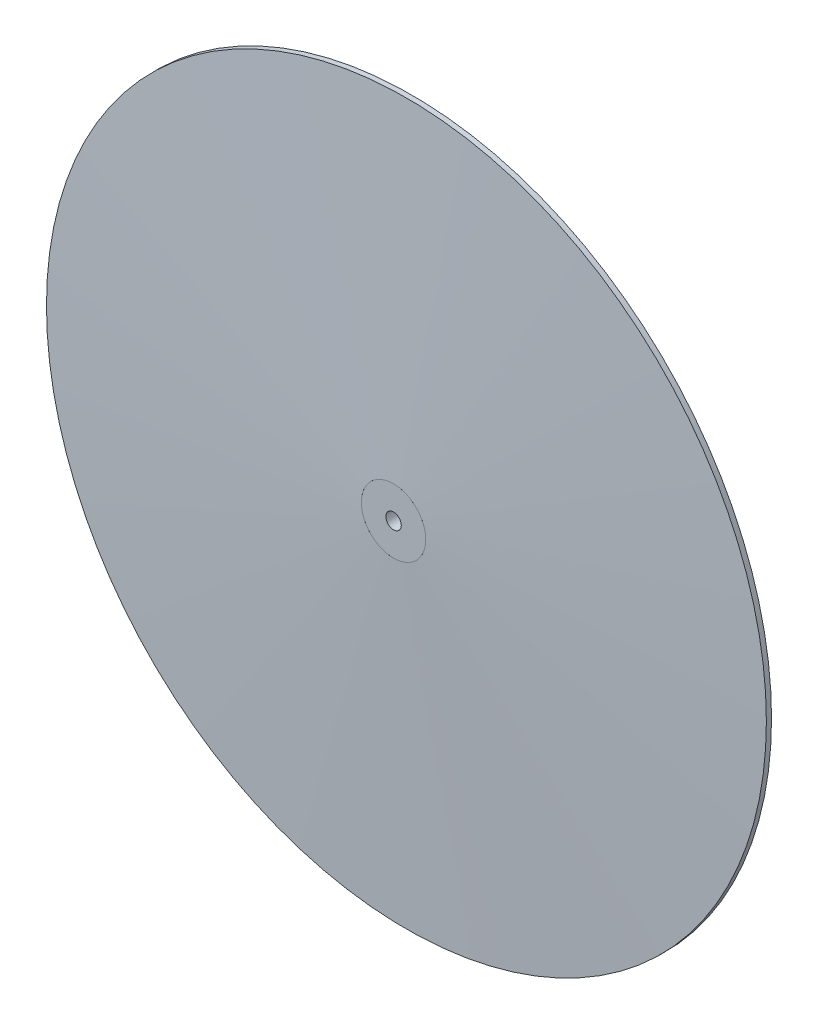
ISO-10303-21;
HEADER;
FILE_DESCRIPTION(('STEP AP214'),'2;1');
FILE_NAME('part.step','',(''),(''),'','','');
FILE_SCHEMA(('AUTOMOTIVE_DESIGN { 1 0 10303 214 1 1 1 1 }'));
ENDSEC;
DATA;
#1=APPLICATION_CONTEXT('core data for automotive mechanical design processes');
#2=APPLICATION_PROTOCOL_DEFINITION('international standard','automotive_design',2000,#1);
#3=PRODUCT_CONTEXT('',#1,'mechanical');
#4=PRODUCT('Part','Part','',(#3));
#5=PRODUCT_RELATED_PRODUCT_CATEGORY('part','',(#4));
#6=PRODUCT_DEFINITION_FORMATION('','',#4);
#7=PRODUCT_DEFINITION_CONTEXT('part definition',#1,'design');
#8=PRODUCT_DEFINITION('design','',#6,#7);
#9=PRODUCT_DEFINITION_SHAPE('','',#8);
#10=(LENGTH_UNIT() NAMED_UNIT(*) SI_UNIT(.MILLI.,.METRE.));
#11=(NAMED_UNIT(*) PLANE_ANGLE_UNIT() SI_UNIT($,.RADIAN.));
#12=(NAMED_UNIT(*) SI_UNIT($,.STERADIAN.) SOLID_ANGLE_UNIT());
#13=UNCERTAINTY_MEASURE_WITH_UNIT(LENGTH_MEASURE(1.E-05),#10,'distance_accuracy_value','');
#14=(GEOMETRIC_REPRESENTATION_CONTEXT(3) GLOBAL_UNCERTAINTY_ASSIGNED_CONTEXT((#13)) GLOBAL_UNIT_ASSIGNED_CONTEXT((#10,
#11,#12)) REPRESENTATION_CONTEXT('',''));
#15=CARTESIAN_POINT('',(0.,0.,0.));
#16=DIRECTION('',(0.,0.,1.));
#17=DIRECTION('',(1.,0.,0.));
#18=AXIS2_PLACEMENT_3D('',#15,#16,#17);
#19=CARTESIAN_POINT('',(0.,0.,12.));
#20=DIRECTION('',(0.,0.,-1.));
#21=DIRECTION('',(-1.,0.,0.));
#22=AXIS2_PLACEMENT_3D('',#19,#20,#21);
#23=CONICAL_SURFACE('',#22,25.,1.53152379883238);
#24=CARTESIAN_POINT('',(0.,0.,2.));
#25=DIRECTION('',(0.,0.,1.));
#26=DIRECTION('',(1.,0.,0.));
#27=AXIS2_PLACEMENT_3D('',#24,#25,#26);
#28=CIRCLE('',#27,279.5);
#29=CARTESIAN_POINT('',(-279.5,0.,2.));
#30=VERTEX_POINT('',#29);
#31=EDGE_CURVE('E54',#30,#30,#28,.T.);
#32=CARTESIAN_POINT('',(0.,0.,12.));
#33=DIRECTION('',(0.,0.,1.));
#34=DIRECTION('',(1.,0.,0.));
#35=AXIS2_PLACEMENT_3D('',#32,#33,#34);
#36=CIRCLE('',#35,25.);
#37=CARTESIAN_POINT('',(-25.,0.,12.));
#38=VERTEX_POINT('',#37);
#39=EDGE_CURVE('E11',#38,#38,#36,.T.);
#40=CARTESIAN_POINT('',(-279.5,0.,2.));
#41=CARTESIAN_POINT('',(-276.848958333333,0.,2.10416666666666));
#42=CARTESIAN_POINT('',(-274.197916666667,0.,2.20833333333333));
#43=CARTESIAN_POINT('',(-268.895833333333,0.,2.41666666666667));
#44=CARTESIAN_POINT('',(-266.244791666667,0.,2.52083333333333));
#45=CARTESIAN_POINT('',(-260.942708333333,0.,2.72916666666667));
#46=CARTESIAN_POINT('',(-258.291666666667,0.,2.83333333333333));
#47=CARTESIAN_POINT('',(-252.989583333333,0.,3.04166666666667));
#48=CARTESIAN_POINT('',(-250.338541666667,0.,3.14583333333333));
#49=CARTESIAN_POINT('',(-245.036458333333,0.,3.35416666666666));
#50=CARTESIAN_POINT('',(-242.385416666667,0.,3.45833333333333));
#51=CARTESIAN_POINT('',(-237.083333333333,0.,3.66666666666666));
#52=CARTESIAN_POINT('',(-234.432291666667,0.,3.77083333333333));
#53=CARTESIAN_POINT('',(-229.130208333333,0.,3.97916666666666));
#54=CARTESIAN_POINT('',(-226.479166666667,0.,4.08333333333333));
#55=CARTESIAN_POINT('',(-221.177083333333,0.,4.29166666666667));
#56=CARTESIAN_POINT('',(-218.526041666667,0.,4.39583333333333));
#57=CARTESIAN_POINT('',(-213.223958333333,0.,4.60416666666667));
#58=CARTESIAN_POINT('',(-210.572916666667,0.,4.70833333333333));
#59=CARTESIAN_POINT('',(-205.270833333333,0.,4.91666666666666));
#60=CARTESIAN_POINT('',(-202.619791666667,0.,5.02083333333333));
#61=CARTESIAN_POINT('',(-197.317708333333,0.,5.22916666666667));
#62=CARTESIAN_POINT('',(-194.666666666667,0.,5.33333333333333));
#63=CARTESIAN_POINT('',(-189.364583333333,0.,5.54166666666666));
#64=CARTESIAN_POINT('',(-186.713541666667,0.,5.64583333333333));
#65=CARTESIAN_POINT('',(-181.411458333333,0.,5.85416666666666));
#66=CARTESIAN_POINT('',(-178.760416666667,0.,5.95833333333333));
#67=CARTESIAN_POINT('',(-173.458333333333,0.,6.16666666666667));
#68=CARTESIAN_POINT('',(-170.807291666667,0.,6.27083333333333));
#69=CARTESIAN_POINT('',(-165.505208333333,0.,6.47916666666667));
#70=CARTESIAN_POINT('',(-162.854166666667,0.,6.58333333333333));
#71=CARTESIAN_POINT('',(-157.552083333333,0.,6.79166666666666));
#72=CARTESIAN_POINT('',(-154.901041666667,0.,6.89583333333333));
#73=CARTESIAN_POINT('',(-149.598958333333,0.,7.10416666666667));
#74=CARTESIAN_POINT('',(-146.947916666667,0.,7.20833333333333));
#75=CARTESIAN_POINT('',(-141.645833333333,0.,7.41666666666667));
#76=CARTESIAN_POINT('',(-138.994791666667,0.,7.52083333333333));
#77=CARTESIAN_POINT('',(-133.692708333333,0.,7.72916666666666));
#78=CARTESIAN_POINT('',(-131.041666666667,0.,7.83333333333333));
#79=CARTESIAN_POINT('',(-125.739583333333,0.,8.04166666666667));
#80=CARTESIAN_POINT('',(-123.088541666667,0.,8.14583333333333));
#81=CARTESIAN_POINT('',(-117.786458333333,0.,8.35416666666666));
#82=CARTESIAN_POINT('',(-115.135416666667,0.,8.45833333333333));
#83=CARTESIAN_POINT('',(-109.833333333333,0.,8.66666666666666));
#84=CARTESIAN_POINT('',(-107.182291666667,0.,8.77083333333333));
#85=CARTESIAN_POINT('',(-101.880208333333,0.,8.97916666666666));
#86=CARTESIAN_POINT('',(-99.2291666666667,0.,9.08333333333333));
#87=CARTESIAN_POINT('',(-93.9270833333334,0.,9.29166666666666));
#88=CARTESIAN_POINT('',(-91.2760416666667,0.,9.39583333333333));
#89=CARTESIAN_POINT('',(-85.9739583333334,0.,9.60416666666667));
#90=CARTESIAN_POINT('',(-83.3229166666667,0.,9.70833333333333));
#91=CARTESIAN_POINT('',(-78.0208333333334,0.,9.91666666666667));
#92=CARTESIAN_POINT('',(-75.3697916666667,0.,10.0208333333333));
#93=CARTESIAN_POINT('',(-70.0677083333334,0.,10.2291666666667));
#94=CARTESIAN_POINT('',(-67.4166666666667,0.,10.3333333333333));
#95=CARTESIAN_POINT('',(-62.1145833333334,0.,10.5416666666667));
#96=CARTESIAN_POINT('',(-59.4635416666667,0.,10.6458333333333));
#97=CARTESIAN_POINT('',(-54.1614583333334,0.,10.8541666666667));
#98=CARTESIAN_POINT('',(-51.5104166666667,0.,10.9583333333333));
#99=CARTESIAN_POINT('',(-46.2083333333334,0.,11.1666666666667));
#100=CARTESIAN_POINT('',(-43.5572916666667,0.,11.2708333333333));
#101=CARTESIAN_POINT('',(-38.2552083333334,0.,11.4791666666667));
#102=CARTESIAN_POINT('',(-35.6041666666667,0.,11.5833333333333));
#103=CARTESIAN_POINT('',(-30.3020833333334,0.,11.7916666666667));
#104=CARTESIAN_POINT('',(-27.6510416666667,0.,11.8958333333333));
#105=CARTESIAN_POINT('',(-25.,0.,12.));
#106=B_SPLINE_CURVE_WITH_KNOTS('',3,(#40,#41,#42,#43,#44,#45,#46,#47,#48,#49,#50,#51,#52,#53,
#54,#55,#56,#57,#58,#59,#60,#61,#62,#63,#64,#65,#66,#67,#68,#69,#70,#71,#72,#73,#74,#75,#76,#77,
#78,#79,#80,#81,#82,#83,#84,#85,#86,#87,#88,#89,#90,#91,#92,#93,#94,#95,#96,#97,#98,#99,#100,
#101,#102,#103,#104,#105),.UNSPECIFIED.,.F.,.F.,(4,2,2,2,2,2,2,2,2,2,2,2,2,2,2,2,2,2,2,2,2,2,2,
2,2,2,2,2,2,2,2,2,4),(0.,7.95926212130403,15.9185242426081,23.8777863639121,31.8370484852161,
39.7963106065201,47.7555727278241,55.7148348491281,63.6740969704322,71.6333590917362,
79.5926212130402,87.5518833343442,95.5111454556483,103.470407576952,111.429669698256,
119.38893181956,127.348193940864,135.307456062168,143.266718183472,151.225980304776,
159.18524242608,167.144504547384,175.103766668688,183.063028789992,191.022290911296,
198.9815530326,206.940815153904,214.900077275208,222.859339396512,230.818601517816,
238.77786363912,246.737125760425,254.696387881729),.UNSPECIFIED.);
#107=EDGE_CURVE('BSEAM40',#30,#38,#106,.T.);
#108=ORIENTED_EDGE('',*,*,#31,.T.);
#109=ORIENTED_EDGE('',*,*,#39,.F.);
#110=ORIENTED_EDGE('',*,*,#107,.T.);
#111=ORIENTED_EDGE('',*,*,#107,.F.);
#112=EDGE_LOOP('',(#108,#110,#109,#111));
#113=FACE_BOUND('',#112,.T.);
#114=ADVANCED_FACE('F40',(#113),#23,.T.);
#115=CARTESIAN_POINT('',(0.,0.,0.));
#116=DIRECTION('',(0.,0.,1.));
#117=DIRECTION('',(1.,0.,0.));
#118=AXIS2_PLACEMENT_3D('',#115,#116,#117);
#119=CYLINDRICAL_SURFACE('',#118,25.);
#120=ORIENTED_EDGE('',*,*,#39,.T.);
#121=EDGE_LOOP('',(#120));
#122=FACE_BOUND('',#121,.T.);
#123=CARTESIAN_POINT('',(0.,0.,-12.));
#124=DIRECTION('',(0.,0.,1.));
#125=DIRECTION('',(1.,0.,0.));
#126=AXIS2_PLACEMENT_3D('',#123,#124,#125);
#127=CIRCLE('',#126,25.);
#128=CARTESIAN_POINT('',(25.0000000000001,0.,-12.));
#129=VERTEX_POINT('',#128);
#130=EDGE_CURVE('E46',#129,#129,#127,.T.);
#131=ORIENTED_EDGE('',*,*,#130,.F.);
#132=EDGE_LOOP('',(#131));
#133=FACE_BOUND('',#132,.T.);
#134=ADVANCED_FACE('F70',(#122,#133),#119,.F.);
#135=CARTESIAN_POINT('',(0.,0.,-2.));
#136=DIRECTION('',(0.,0.,1.));
#137=DIRECTION('',(1.,0.,0.));
#138=AXIS2_PLACEMENT_3D('',#135,#136,#137);
#139=CONICAL_SURFACE('',#138,279.5,1.53152379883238);
#140=CARTESIAN_POINT('',(0.,0.,-2.));
#141=DIRECTION('',(0.,0.,1.));
#142=DIRECTION('',(1.,0.,0.));
#143=AXIS2_PLACEMENT_3D('',#140,#141,#142);
#144=CIRCLE('',#143,279.5);
#145=CARTESIAN_POINT('',(279.5,0.,-2.));
#146=VERTEX_POINT('',#145);
#147=EDGE_CURVE('E50',#146,#146,#144,.T.);
#148=CARTESIAN_POINT('',(25.0000000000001,0.,-12.));
#149=CARTESIAN_POINT('',(27.6510416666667,0.,-11.8958333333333));
#150=CARTESIAN_POINT('',(30.3020833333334,0.,-11.7916666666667));
#151=CARTESIAN_POINT('',(35.6041666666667,0.,-11.5833333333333));
#152=CARTESIAN_POINT('',(38.2552083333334,0.,-11.4791666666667));
#153=CARTESIAN_POINT('',(43.5572916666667,0.,-11.2708333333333));
#154=CARTESIAN_POINT('',(46.2083333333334,0.,-11.1666666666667));
#155=CARTESIAN_POINT('',(51.5104166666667,0.,-10.9583333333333));
#156=CARTESIAN_POINT('',(54.1614583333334,0.,-10.8541666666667));
#157=CARTESIAN_POINT('',(59.4635416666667,0.,-10.6458333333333));
#158=CARTESIAN_POINT('',(62.1145833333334,0.,-10.5416666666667));
#159=CARTESIAN_POINT('',(67.4166666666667,0.,-10.3333333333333));
#160=CARTESIAN_POINT('',(70.0677083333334,0.,-10.2291666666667));
#161=CARTESIAN_POINT('',(75.3697916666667,0.,-10.0208333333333));
#162=CARTESIAN_POINT('',(78.0208333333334,0.,-9.91666666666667));
#163=CARTESIAN_POINT('',(83.3229166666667,0.,-9.70833333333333));
#164=CARTESIAN_POINT('',(85.9739583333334,0.,-9.60416666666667));
#165=CARTESIAN_POINT('',(91.2760416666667,0.,-9.39583333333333));
#166=CARTESIAN_POINT('',(93.9270833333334,0.,-9.29166666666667));
#167=CARTESIAN_POINT('',(99.2291666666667,0.,-9.08333333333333));
#168=CARTESIAN_POINT('',(101.880208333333,0.,-8.97916666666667));
#169=CARTESIAN_POINT('',(107.182291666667,0.,-8.77083333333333));
#170=CARTESIAN_POINT('',(109.833333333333,0.,-8.66666666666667));
#171=CARTESIAN_POINT('',(115.135416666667,0.,-8.45833333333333));
#172=CARTESIAN_POINT('',(117.786458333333,0.,-8.35416666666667));
#173=CARTESIAN_POINT('',(123.088541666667,0.,-8.14583333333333));
#174=CARTESIAN_POINT('',(125.739583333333,0.,-8.04166666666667));
#175=CARTESIAN_POINT('',(131.041666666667,0.,-7.83333333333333));
#176=CARTESIAN_POINT('',(133.692708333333,0.,-7.72916666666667));
#177=CARTESIAN_POINT('',(138.994791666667,0.,-7.52083333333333));
#178=CARTESIAN_POINT('',(141.645833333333,0.,-7.41666666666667));
#179=CARTESIAN_POINT('',(146.947916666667,0.,-7.20833333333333));
#180=CARTESIAN_POINT('',(149.598958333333,0.,-7.10416666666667));
#181=CARTESIAN_POINT('',(154.901041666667,0.,-6.89583333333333));
#182=CARTESIAN_POINT('',(157.552083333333,0.,-6.79166666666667));
#183=CARTESIAN_POINT('',(162.854166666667,0.,-6.58333333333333));
#184=CARTESIAN_POINT('',(165.505208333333,0.,-6.47916666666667));
#185=CARTESIAN_POINT('',(170.807291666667,0.,-6.27083333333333));
#186=CARTESIAN_POINT('',(173.458333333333,0.,-6.16666666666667));
#187=CARTESIAN_POINT('',(178.760416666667,0.,-5.95833333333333));
#188=CARTESIAN_POINT('',(181.411458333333,0.,-5.85416666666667));
#189=CARTESIAN_POINT('',(186.713541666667,0.,-5.64583333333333));
#190=CARTESIAN_POINT('',(189.364583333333,0.,-5.54166666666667));
#191=CARTESIAN_POINT('',(194.666666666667,0.,-5.33333333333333));
#192=CARTESIAN_POINT('',(197.317708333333,0.,-5.22916666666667));
#193=CARTESIAN_POINT('',(202.619791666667,0.,-5.02083333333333));
#194=CARTESIAN_POINT('',(205.270833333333,0.,-4.91666666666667));
#195=CARTESIAN_POINT('',(210.572916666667,0.,-4.70833333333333));
#196=CARTESIAN_POINT('',(213.223958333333,0.,-4.60416666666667));
#197=CARTESIAN_POINT('',(218.526041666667,0.,-4.39583333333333));
#198=CARTESIAN_POINT('',(221.177083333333,0.,-4.29166666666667));
#199=CARTESIAN_POINT('',(226.479166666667,0.,-4.08333333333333));
#200=CARTESIAN_POINT('',(229.130208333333,0.,-3.97916666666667));
#201=CARTESIAN_POINT('',(234.432291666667,0.,-3.77083333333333));
#202=CARTESIAN_POINT('',(237.083333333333,0.,-3.66666666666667));
#203=CARTESIAN_POINT('',(242.385416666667,0.,-3.45833333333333));
#204=CARTESIAN_POINT('',(245.036458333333,0.,-3.35416666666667));
#205=CARTESIAN_POINT('',(250.338541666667,0.,-3.14583333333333));
#206=CARTESIAN_POINT('',(252.989583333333,0.,-3.04166666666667));
#207=CARTESIAN_POINT('',(258.291666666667,0.,-2.83333333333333));
#208=CARTESIAN_POINT('',(260.942708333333,0.,-2.72916666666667));
#209=CARTESIAN_POINT('',(266.244791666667,0.,-2.52083333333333));
#210=CARTESIAN_POINT('',(268.895833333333,0.,-2.41666666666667));
#211=CARTESIAN_POINT('',(274.197916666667,0.,-2.20833333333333));
#212=CARTESIAN_POINT('',(276.848958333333,0.,-2.10416666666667));
#213=CARTESIAN_POINT('',(279.5,0.,-2.));
#214=B_SPLINE_CURVE_WITH_KNOTS('',3,(#148,#149,#150,#151,#152,#153,#154,#155,#156,#157,#158,
#159,#160,#161,#162,#163,#164,#165,#166,#167,#168,#169,#170,#171,#172,#173,#174,#175,#176,#177,
#178,#179,#180,#181,#182,#183,#184,#185,#186,#187,#188,#189,#190,#191,#192,#193,#194,#195,#196,
#197,#198,#199,#200,#201,#202,#203,#204,#205,#206,#207,#208,#209,#210,#211,#212,#213),
.UNSPECIFIED.,.F.,.F.,(4,2,2,2,2,2,2,2,2,2,2,2,2,2,2,2,2,2,2,2,2,2,2,2,2,2,2,2,2,2,2,2,4),(0.,
7.959262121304,15.918524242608,23.8777863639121,31.8370484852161,39.7963106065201,
47.7555727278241,55.7148348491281,63.6740969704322,71.6333590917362,79.5926212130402,
87.5518833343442,95.5111454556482,103.470407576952,111.429669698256,119.38893181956,
127.348193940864,135.307456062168,143.266718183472,151.225980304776,159.18524242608,
167.144504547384,175.103766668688,183.063028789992,191.022290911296,198.9815530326,
206.940815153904,214.900077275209,222.859339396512,230.818601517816,238.77786363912,
246.737125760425,254.696387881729),.UNSPECIFIED.);
#215=EDGE_CURVE('BSEAM64',#129,#146,#214,.T.);
#216=ORIENTED_EDGE('',*,*,#130,.T.);
#217=ORIENTED_EDGE('',*,*,#147,.F.);
#218=ORIENTED_EDGE('',*,*,#215,.T.);
#219=ORIENTED_EDGE('',*,*,#215,.F.);
#220=EDGE_LOOP('',(#216,#218,#217,#219));
#221=FACE_BOUND('',#220,.T.);
#222=ADVANCED_FACE('F64',(#221),#139,.T.);
#223=CARTESIAN_POINT('',(0.,0.,0.));
#224=DIRECTION('',(0.,0.,1.));
#225=DIRECTION('',(1.,0.,0.));
#226=AXIS2_PLACEMENT_3D('',#223,#224,#225);
#227=CYLINDRICAL_SURFACE('',#226,279.5);
#228=ORIENTED_EDGE('',*,*,#147,.T.);
#229=EDGE_LOOP('',(#228));
#230=FACE_BOUND('',#229,.T.);
#231=ORIENTED_EDGE('',*,*,#31,.F.);
#232=EDGE_LOOP('',(#231));
#233=FACE_BOUND('',#232,.T.);
#234=ADVANCED_FACE('F62',(#230,#233),#227,.T.);
#235=CLOSED_SHELL('',(#114,#134,#222,#234));
#236=MANIFOLD_SOLID_BREP('B2',#235);
#237=CARTESIAN_POINT('',(0.,0.,12.));
#238=DIRECTION('',(0.,0.,1.));
#239=DIRECTION('',(1.,0.,0.));
#240=AXIS2_PLACEMENT_3D('',#237,#238,#239);
#241=PLANE('',#240);
#242=CARTESIAN_POINT('',(0.,0.,12.));
#243=DIRECTION('',(0.,0.,1.));
#244=DIRECTION('',(1.,0.,0.));
#245=AXIS2_PLACEMENT_3D('',#242,#243,#244);
#246=CIRCLE('',#245,25.);
#247=CARTESIAN_POINT('',(25.,0.,12.));
#248=VERTEX_POINT('',#247);
#249=EDGE_CURVE('E39',#248,#248,#246,.T.);
#250=ORIENTED_EDGE('',*,*,#249,.T.);
#251=EDGE_LOOP('',(#250));
#252=FACE_BOUND('',#251,.T.);
#253=CARTESIAN_POINT('',(0.,0.,12.));
#254=DIRECTION('',(0.,0.,1.));
#255=DIRECTION('',(1.,0.,0.));
#256=AXIS2_PLACEMENT_3D('',#253,#254,#255);
#257=CIRCLE('',#256,6.);
#258=CARTESIAN_POINT('',(6.,0.,12.));
#259=VERTEX_POINT('',#258);
#260=EDGE_CURVE('E112',#259,#259,#257,.T.);
#261=ORIENTED_EDGE('',*,*,#260,.F.);
#262=EDGE_LOOP('',(#261));
#263=FACE_BOUND('',#262,.T.);
#264=ADVANCED_FACE('F101',(#252,#263),#241,.T.);
#265=CARTESIAN_POINT('',(0.,0.,-12.));
#266=DIRECTION('',(0.,0.,1.));
#267=DIRECTION('',(1.,0.,0.));
#268=AXIS2_PLACEMENT_3D('',#265,#266,#267);
#269=PLANE('',#268);
#270=CARTESIAN_POINT('',(0.,0.,-12.));
#271=DIRECTION('',(0.,0.,1.));
#272=DIRECTION('',(1.,0.,0.));
#273=AXIS2_PLACEMENT_3D('',#270,#271,#272);
#274=CIRCLE('',#273,25.);
#275=CARTESIAN_POINT('',(25.,0.,-12.));
#276=VERTEX_POINT('',#275);
#277=EDGE_CURVE('E105',#276,#276,#274,.T.);
#278=ORIENTED_EDGE('',*,*,#277,.F.);
#279=EDGE_LOOP('',(#278));
#280=FACE_BOUND('',#279,.T.);
#281=CARTESIAN_POINT('',(0.,0.,-12.));
#282=DIRECTION('',(0.,0.,1.));
#283=DIRECTION('',(1.,0.,0.));
#284=AXIS2_PLACEMENT_3D('',#281,#282,#283);
#285=CIRCLE('',#284,6.);
#286=CARTESIAN_POINT('',(6.,0.,-12.));
#287=VERTEX_POINT('',#286);
#288=EDGE_CURVE('E114',#287,#287,#285,.T.);
#289=ORIENTED_EDGE('',*,*,#288,.T.);
#290=EDGE_LOOP('',(#289));
#291=FACE_BOUND('',#290,.T.);
#292=ADVANCED_FACE('F124',(#280,#291),#269,.F.);
#293=CARTESIAN_POINT('',(0.,0.,12.));
#294=DIRECTION('',(0.,0.,-1.));
#295=DIRECTION('',(-1.,0.,0.));
#296=AXIS2_PLACEMENT_3D('',#293,#294,#295);
#297=CYLINDRICAL_SURFACE('',#296,25.);
#298=ORIENTED_EDGE('',*,*,#249,.F.);
#299=EDGE_LOOP('',(#298));
#300=FACE_BOUND('',#299,.T.);
#301=ORIENTED_EDGE('',*,*,#277,.T.);
#302=EDGE_LOOP('',(#301));
#303=FACE_BOUND('',#302,.T.);
#304=ADVANCED_FACE('F103',(#300,#303),#297,.T.);
#305=CARTESIAN_POINT('',(0.,0.,12.));
#306=DIRECTION('',(0.,0.,-1.));
#307=DIRECTION('',(-1.,0.,0.));
#308=AXIS2_PLACEMENT_3D('',#305,#306,#307);
#309=CYLINDRICAL_SURFACE('',#308,6.);
#310=ORIENTED_EDGE('',*,*,#260,.T.);
#311=EDGE_LOOP('',(#310));
#312=FACE_BOUND('',#311,.T.);
#313=ORIENTED_EDGE('',*,*,#288,.F.);
#314=EDGE_LOOP('',(#313));
#315=FACE_BOUND('',#314,.T.);
#316=ADVANCED_FACE('F120',(#312,#315),#309,.F.);
#317=CLOSED_SHELL('',(#264,#292,#304,#316));
#318=MANIFOLD_SOLID_BREP('B6',#317);
#319=ADVANCED_BREP_SHAPE_REPRESENTATION('',(#18,#236,#318),#14);
#320=SHAPE_DEFINITION_REPRESENTATION(#9,#319);
ENDSEC;
END-ISO-10303-21;
